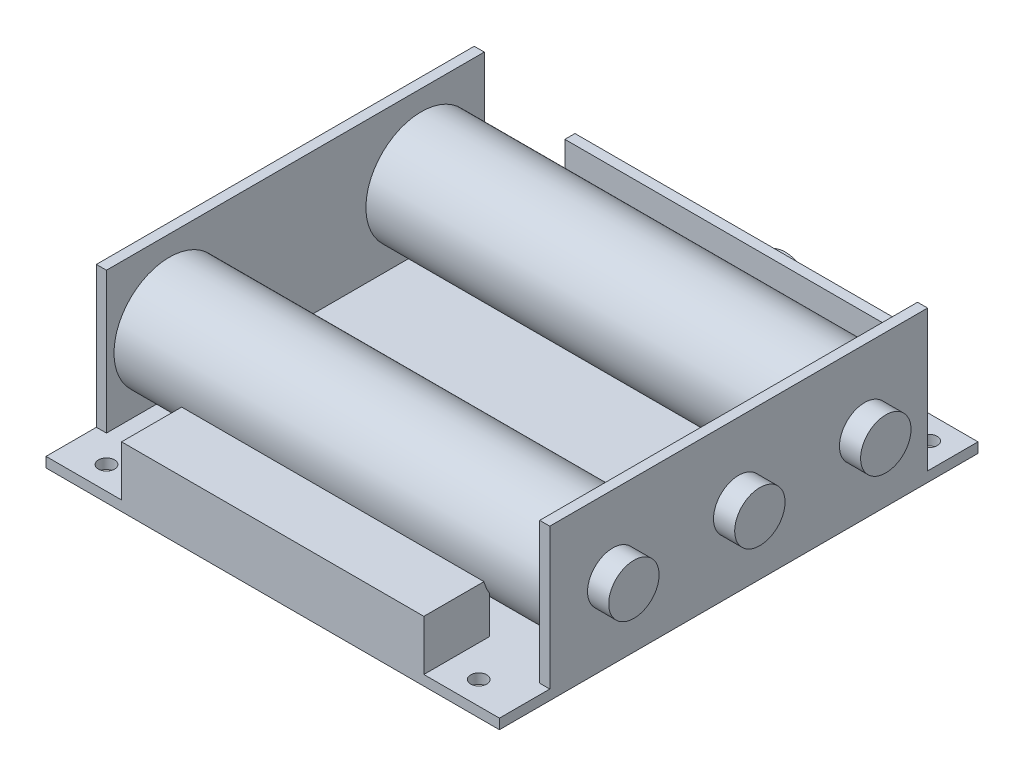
from build123d import *

# Parameters (mm, degrees)
SKETCH1_W                  = 90
SKETCH1_H                  = 95
BOSS_EXTRUDE1_DEPTH        = 2
F_3_2_3_2_DIAMETER_HOLE1_D = 3.2
SKETCH4_W                  = 75
SKETCH4_H                  = 30
BOSS_EXTRUDE2_DEPTH        = 2
BOSS_EXTRUDE3_DEPTH        = 4.2
BOSS_EXTRUDE3_DEPTH_BACK   = 94.2
SKETCH5_R                  = 5
SKETCH6_W                  = 60
SKETCH6_H                  = 13
BOSS_EXTRUDE4_DEPTH        = 10
SKETCH7_R                  = 5
BOSS_EXTRUDE5_DEPTH        = 4.2
SKETCH8_W                  = 70
SKETCH8_H                  = 15
BOSS_EXTRUDE6_DEPTH        = 2
SKETCH9_R                  = 5
BOSS_EXTRUDE7_DEPTH        = 4.2


with BuildPart() as part:
    # Sketch1 → Boss-Extrude1 (new body)
    with BuildSketch(Plane(origin=(0, 0, 0), x_dir=(1, 0, 0), z_dir=(0, 1, 0))):
        Rectangle(SKETCH1_W, SKETCH1_H)
    extrude(amount=BOSS_EXTRUDE1_DEPTH)

    # 3.2 _3.2_ Diameter Hole1 (through all)
    with Locations(Plane(origin=(0, 0, 0), x_dir=(-1, 0, 0), z_dir=(0, -1, 0))):
        with Locations((37.6, -42.9), (-36.3, -42.9), (-40, 42.8), (40.2, 42.8)):
            Hole(F_3_2_3_2_DIAMETER_HOLE1_D / 2)

    # Sketch4 → Boss-Extrude2 (add)
    with BuildSketch(Plane(origin=(45, 0, 0), x_dir=(0, 0, -1), z_dir=(1, 0, 0))):
        with Locations((0, 15)):
            Rectangle(SKETCH4_W, SKETCH4_H)
    boss_extrude2 = extrude(amount=-BOSS_EXTRUDE2_DEPTH)

    # Mirror1: Boss-Extrude2 across plane
    add(boss_extrude2.mirror(Plane(origin=(0, 0, 0), x_dir=(0, 0, 1), z_dir=(1, 0, 0))))

    # Sketch5 → Boss-Extrude3 (add, two sides: drawn at the far end of the back side and taken through both)
    with BuildSketch(Plane(origin=(45, 0, 0), x_dir=(0, 0, -1), z_dir=(1, 0, 0)).offset(-BOSS_EXTRUDE3_DEPTH_BACK)):
        with Locations((-25, 15)):
            Circle(SKETCH5_R)
        with Locations((25, 15)):
            Circle(SKETCH5_R)
    extrude(amount=BOSS_EXTRUDE3_DEPTH + BOSS_EXTRUDE3_DEPTH_BACK)

    # Sketch6 → Boss-Extrude4 (add)
    with BuildSketch(Plane(origin=(0, 2, 0), x_dir=(1, 0, 0), z_dir=(0, 1, 0))):
        with Locations((0, -41)):
            Rectangle(SKETCH6_W, SKETCH6_H)
    extrude(amount=BOSS_EXTRUDE4_DEPTH)

    # Sketch7 → Boss-Extrude5 (add)
    with BuildSketch(Plane.ZY.offset(45)):
        with Locations(Location((0, 15, 0), (0, 0, 180))):
            Circle(SKETCH7_R)
    boss_extrude5 = extrude(amount=BOSS_EXTRUDE5_DEPTH)

    # Mirror2: Boss-Extrude5 across plane
    add(boss_extrude5.mirror(Plane(origin=(0, 0, 0), x_dir=(0, 0, 1), z_dir=(1, 0, 0))))

    # Sketch8 → Boss-Extrude6 (add)
    with BuildSketch(Plane(origin=(0, 0, -47.5), x_dir=(-1, 0, 0), z_dir=(0, 0, -1))):
        with Locations((0, 7.5)):
            Rectangle(SKETCH8_W, SKETCH8_H)
    extrude(amount=-BOSS_EXTRUDE6_DEPTH)

    # Sketch9 → Boss-Extrude7 (add)
    with BuildSketch(Plane(origin=(0, 0, -47.5), x_dir=(-1, 0, 0), z_dir=(0, 0, -1))):
        with Locations(Location((-2.55, 6.3, 0), (0, 0, 180))):
            Circle(SKETCH9_R)
    extrude(amount=BOSS_EXTRUDE7_DEPTH)


solid = part.part
